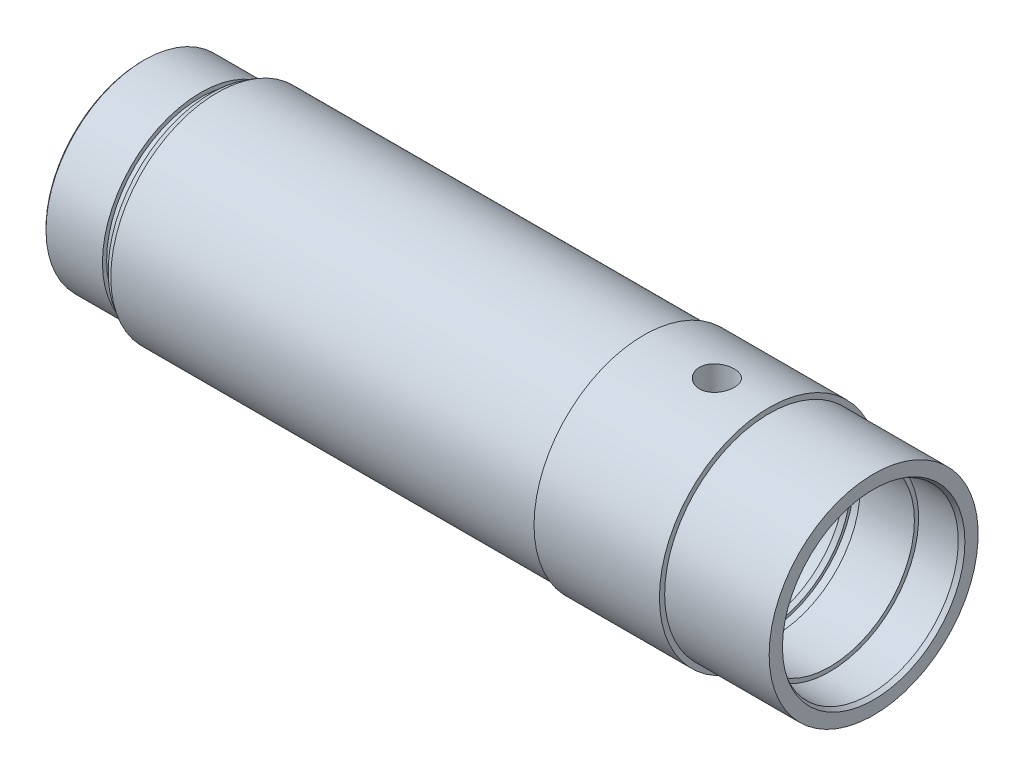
ISO-10303-21;
HEADER;
FILE_DESCRIPTION(('STEP AP214'),'2;1');
FILE_NAME('part.step','',(''),(''),'','','');
FILE_SCHEMA(('AUTOMOTIVE_DESIGN { 1 0 10303 214 1 1 1 1 }'));
ENDSEC;
DATA;
#1=APPLICATION_CONTEXT('core data for automotive mechanical design processes');
#2=APPLICATION_PROTOCOL_DEFINITION('international standard','automotive_design',2000,#1);
#3=PRODUCT_CONTEXT('',#1,'mechanical');
#4=PRODUCT('Part','Part','',(#3));
#5=PRODUCT_RELATED_PRODUCT_CATEGORY('part','',(#4));
#6=PRODUCT_DEFINITION_FORMATION('','',#4);
#7=PRODUCT_DEFINITION_CONTEXT('part definition',#1,'design');
#8=PRODUCT_DEFINITION('design','',#6,#7);
#9=PRODUCT_DEFINITION_SHAPE('','',#8);
#10=(LENGTH_UNIT() NAMED_UNIT(*) SI_UNIT(.MILLI.,.METRE.));
#11=(NAMED_UNIT(*) PLANE_ANGLE_UNIT() SI_UNIT($,.RADIAN.));
#12=(NAMED_UNIT(*) SI_UNIT($,.STERADIAN.) SOLID_ANGLE_UNIT());
#13=UNCERTAINTY_MEASURE_WITH_UNIT(LENGTH_MEASURE(1.E-05),#10,'distance_accuracy_value','');
#14=(GEOMETRIC_REPRESENTATION_CONTEXT(3) GLOBAL_UNCERTAINTY_ASSIGNED_CONTEXT((#13)) GLOBAL_UNIT_ASSIGNED_CONTEXT((#10,
#11,#12)) REPRESENTATION_CONTEXT('',''));
#15=CARTESIAN_POINT('',(0.,0.,0.));
#16=DIRECTION('',(0.,0.,1.));
#17=DIRECTION('',(1.,0.,0.));
#18=AXIS2_PLACEMENT_3D('',#15,#16,#17);
#19=CARTESIAN_POINT('',(0.,0.,0.));
#20=DIRECTION('',(-1.,0.,0.));
#21=DIRECTION('',(0.,0.,1.));
#22=AXIS2_PLACEMENT_3D('',#19,#20,#21);
#23=CYLINDRICAL_SURFACE('',#22,40.);
#24=CARTESIAN_POINT('',(296.,0.,0.));
#25=DIRECTION('',(-1.,0.,0.));
#26=DIRECTION('',(0.,0.,1.));
#27=AXIS2_PLACEMENT_3D('',#24,#25,#26);
#28=CIRCLE('',#27,40.);
#29=CARTESIAN_POINT('',(296.,0.,40.));
#30=VERTEX_POINT('',#29);
#31=EDGE_CURVE('E44',#30,#30,#28,.F.);
#32=ORIENTED_EDGE('',*,*,#31,.T.);
#33=EDGE_LOOP('',(#32));
#34=FACE_BOUND('',#33,.T.);
#35=CARTESIAN_POINT('',(0.,0.,0.));
#36=DIRECTION('',(-1.,0.,0.));
#37=DIRECTION('',(0.,0.,1.));
#38=AXIS2_PLACEMENT_3D('',#35,#36,#37);
#39=CIRCLE('',#38,40.);
#40=CARTESIAN_POINT('',(0.,0.,40.));
#41=VERTEX_POINT('',#40);
#42=EDGE_CURVE('E65',#41,#41,#39,.T.);
#43=ORIENTED_EDGE('',*,*,#42,.T.);
#44=EDGE_LOOP('',(#43));
#45=FACE_BOUND('',#44,.T.);
#46=CARTESIAN_POINT('',(275.,39.1228122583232,-8.33099999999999));
#47=CARTESIAN_POINT('',(275.231316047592,39.1228094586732,-8.33100494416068));
#48=CARTESIAN_POINT('',(275.462571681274,39.1248675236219,-8.32136365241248));
#49=CARTESIAN_POINT('',(275.923477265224,39.1330323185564,-8.28288617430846));
#50=CARTESIAN_POINT('',(276.153126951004,39.1391397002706,-8.25404689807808));
#51=CARTESIAN_POINT('',(276.609202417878,39.1552293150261,-8.17737971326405));
#52=CARTESIAN_POINT('',(276.835626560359,39.1652134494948,-8.12954248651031));
#53=CARTESIAN_POINT('',(277.283621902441,39.1887651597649,-8.01524107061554));
#54=CARTESIAN_POINT('',(277.505191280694,39.2023340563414,-7.94877001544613));
#55=CARTESIAN_POINT('',(277.941530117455,39.2326360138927,-7.79783184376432));
#56=CARTESIAN_POINT('',(278.156308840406,39.2493645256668,-7.71339057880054));
#57=CARTESIAN_POINT('',(278.578014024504,39.2855249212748,-7.52705362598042));
#58=CARTESIAN_POINT('',(278.784937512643,39.3049578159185,-7.42515140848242));
#59=CARTESIAN_POINT('',(279.189368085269,39.3459627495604,-7.20470485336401));
#60=CARTESIAN_POINT('',(279.386879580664,39.3675337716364,-7.08616841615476));
#61=CARTESIAN_POINT('',(279.771380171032,39.4122318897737,-6.83318941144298));
#62=CARTESIAN_POINT('',(279.958364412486,39.4353596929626,-6.69873959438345));
#63=CARTESIAN_POINT('',(280.32298913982,39.4828510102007,-6.41293547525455));
#64=CARTESIAN_POINT('',(280.500465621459,39.5072271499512,-6.26137399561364));
#65=CARTESIAN_POINT('',(280.841989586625,39.5562223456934,-5.94399178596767));
#66=CARTESIAN_POINT('',(281.006042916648,39.5808412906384,-5.77817732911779));
#67=CARTESIAN_POINT('',(281.319778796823,39.6296607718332,-5.43326161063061));
#68=CARTESIAN_POINT('',(281.469454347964,39.6538610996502,-5.25415395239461));
#69=CARTESIAN_POINT('',(281.753263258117,39.7011514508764,-4.88399100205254));
#70=CARTESIAN_POINT('',(281.887402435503,39.7242418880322,-4.69294022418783));
#71=CARTESIAN_POINT('',(282.140507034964,39.7689024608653,-4.29816678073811));
#72=CARTESIAN_POINT('',(282.25930928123,39.7904553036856,-4.09433748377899));
#73=CARTESIAN_POINT('',(282.479248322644,39.8311676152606,-3.67722373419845));
#74=CARTESIAN_POINT('',(282.580391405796,39.8503279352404,-3.46394268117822));
#75=CARTESIAN_POINT('',(282.764300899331,39.8857199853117,-3.02933554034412));
#76=CARTESIAN_POINT('',(282.847065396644,39.9019514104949,-2.80800861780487));
#77=CARTESIAN_POINT('',(282.993549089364,39.9310168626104,-2.35892245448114));
#78=CARTESIAN_POINT('',(283.057268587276,39.9438509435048,-2.13116331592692));
#79=CARTESIAN_POINT('',(283.164376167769,39.965594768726,-1.6741614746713));
#80=CARTESIAN_POINT('',(283.208041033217,39.9745578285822,-1.44498616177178));
#81=CARTESIAN_POINT('',(283.276008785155,39.9885690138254,-0.983664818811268));
#82=CARTESIAN_POINT('',(283.300311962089,39.9936171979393,-0.751518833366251));
#83=CARTESIAN_POINT('',(283.329355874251,39.9996550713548,-0.285974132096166));
#84=CARTESIAN_POINT('',(283.334098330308,40.0006451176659,-0.0525755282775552));
#85=CARTESIAN_POINT('',(283.323986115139,39.9985394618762,0.413777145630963));
#86=CARTESIAN_POINT('',(283.309131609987,39.9954437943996,0.646731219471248));
#87=CARTESIAN_POINT('',(283.260333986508,39.9853348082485,1.10685569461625));
#88=CARTESIAN_POINT('',(283.226692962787,39.9783835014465,1.33405957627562));
#89=CARTESIAN_POINT('',(283.140793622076,39.9607957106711,1.78485480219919));
#90=CARTESIAN_POINT('',(283.088528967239,39.9501579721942,2.00844488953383));
#91=CARTESIAN_POINT('',(282.965800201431,39.9254906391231,2.45033957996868));
#92=CARTESIAN_POINT('',(282.895339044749,39.9114615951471,2.66864503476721));
#93=CARTESIAN_POINT('',(282.736743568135,39.8803911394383,3.09852387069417));
#94=CARTESIAN_POINT('',(282.648608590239,39.8633496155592,3.31009700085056));
#95=CARTESIAN_POINT('',(282.454664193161,39.826590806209,3.72647870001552));
#96=CARTESIAN_POINT('',(282.34874012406,39.806856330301,3.93123233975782));
#97=CARTESIAN_POINT('',(282.120397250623,39.7653353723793,4.33111040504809));
#98=CARTESIAN_POINT('',(281.997978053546,39.7435488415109,4.52623460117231));
#99=CARTESIAN_POINT('',(281.737487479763,39.6985103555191,4.9055855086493));
#100=CARTESIAN_POINT('',(281.599414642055,39.6752582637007,5.0898112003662));
#101=CARTESIAN_POINT('',(281.308560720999,39.6279168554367,5.44614703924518));
#102=CARTESIAN_POINT('',(281.15577943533,39.6038275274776,5.61825701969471));
#103=CARTESIAN_POINT('',(280.83349890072,39.5550035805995,5.95237251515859));
#104=CARTESIAN_POINT('',(280.663738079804,39.5302653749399,6.11412530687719));
#105=CARTESIAN_POINT('',(280.311151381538,39.4812904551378,6.42278201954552));
#106=CARTESIAN_POINT('',(280.128325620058,39.45705373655,6.56968607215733));
#107=CARTESIAN_POINT('',(279.750830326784,39.4097674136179,6.84763563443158));
#108=CARTESIAN_POINT('',(279.55616015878,39.3867178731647,6.97868029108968));
#109=CARTESIAN_POINT('',(279.156311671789,39.3424693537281,7.22396307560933));
#110=CARTESIAN_POINT('',(278.951133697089,39.3212703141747,7.33820175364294));
#111=CARTESIAN_POINT('',(278.531104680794,39.2812846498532,7.54932165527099));
#112=CARTESIAN_POINT('',(278.316229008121,39.2625046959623,7.64615516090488));
#113=CARTESIAN_POINT('',(277.878912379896,39.2279885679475,7.82130963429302));
#114=CARTESIAN_POINT('',(277.656474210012,39.2122512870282,7.89963733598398));
#115=CARTESIAN_POINT('',(277.205538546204,39.1842851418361,8.03720915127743));
#116=CARTESIAN_POINT('',(276.977040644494,39.1720565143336,8.09645197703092));
#117=CARTESIAN_POINT('',(276.515675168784,39.1514828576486,8.1953613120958));
#118=CARTESIAN_POINT('',(276.282807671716,39.1431377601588,8.23502816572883));
#119=CARTESIAN_POINT('',(275.818780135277,39.130704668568,8.29390379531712));
#120=CARTESIAN_POINT('',(275.587668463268,39.1265406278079,8.31347817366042));
#121=CARTESIAN_POINT('',(275.124581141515,39.1223255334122,8.3332916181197));
#122=CARTESIAN_POINT('',(274.892605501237,39.1222744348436,8.33353089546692));
#123=CARTESIAN_POINT('',(274.42949185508,39.1262866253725,8.31467297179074));
#124=CARTESIAN_POINT('',(274.198353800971,39.1303496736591,8.29557690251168));
#125=CARTESIAN_POINT('',(273.738577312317,39.1424681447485,8.23820641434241));
#126=CARTESIAN_POINT('',(273.50993887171,39.1505235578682,8.19993204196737));
#127=CARTESIAN_POINT('',(273.059238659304,39.1702801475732,8.10502755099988));
#128=CARTESIAN_POINT('',(272.837132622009,39.1819412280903,8.04859904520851));
#129=CARTESIAN_POINT('',(272.398430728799,39.2086042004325,7.91769004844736));
#130=CARTESIAN_POINT('',(272.181836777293,39.2236072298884,7.84320340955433));
#131=CARTESIAN_POINT('',(271.755765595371,39.2565203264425,7.67677014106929));
#132=CARTESIAN_POINT('',(271.546286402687,39.2744295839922,7.58482837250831));
#133=CARTESIAN_POINT('',(271.135699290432,39.3126628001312,7.38410313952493));
#134=CARTESIAN_POINT('',(270.934594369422,39.3329876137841,7.27531370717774));
#135=CARTESIAN_POINT('',(270.539419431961,39.3757805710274,7.04005612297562));
#136=CARTESIAN_POINT('',(270.345485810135,39.3982745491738,6.91336354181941));
#137=CARTESIAN_POINT('',(269.968933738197,39.4445325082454,6.64435659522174));
#138=CARTESIAN_POINT('',(269.786315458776,39.4682965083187,6.50204199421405));
#139=CARTESIAN_POINT('',(269.433552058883,39.5164426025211,6.20272040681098));
#140=CARTESIAN_POINT('',(269.263410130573,39.5408248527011,6.04570968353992));
#141=CARTESIAN_POINT('',(268.93682585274,39.5895244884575,5.71812528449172));
#142=CARTESIAN_POINT('',(268.780379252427,39.6138418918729,5.54755584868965));
#143=CARTESIAN_POINT('',(268.479639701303,39.6621624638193,5.19093297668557));
#144=CARTESIAN_POINT('',(268.335597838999,39.6861533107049,5.00466601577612));
#145=CARTESIAN_POINT('',(268.063719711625,39.7327129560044,4.62049273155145));
#146=CARTESIAN_POINT('',(267.935883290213,39.7552817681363,4.42258652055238));
#147=CARTESIAN_POINT('',(267.697341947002,39.7983603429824,4.01649085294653));
#148=CARTESIAN_POINT('',(267.586636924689,39.8188701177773,3.80830145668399));
#149=CARTESIAN_POINT('',(267.383191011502,39.8572481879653,3.38309421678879));
#150=CARTESIAN_POINT('',(267.290449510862,39.8751165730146,3.16607667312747));
#151=CARTESIAN_POINT('',(267.124134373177,39.907606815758,2.72604097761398));
#152=CARTESIAN_POINT('',(267.050451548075,39.9222470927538,2.50306546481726));
#153=CARTESIAN_POINT('',(266.922152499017,39.9479925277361,2.05158303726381));
#154=CARTESIAN_POINT('',(266.867529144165,39.9590990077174,1.82307822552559));
#155=CARTESIAN_POINT('',(266.777751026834,39.977467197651,1.36210360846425));
#156=CARTESIAN_POINT('',(266.742597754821,39.9847286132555,1.12963350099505));
#157=CARTESIAN_POINT('',(266.692058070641,39.9951962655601,0.662464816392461));
#158=CARTESIAN_POINT('',(266.67667137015,39.99840256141,0.427766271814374));
#159=CARTESIAN_POINT('',(266.66589611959,40.000646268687,-0.0376302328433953));
#160=CARTESIAN_POINT('',(266.670132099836,39.9997619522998,-0.26831920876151));
#161=CARTESIAN_POINT('',(266.697717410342,39.9940264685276,-0.728583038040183));
#162=CARTESIAN_POINT('',(266.721073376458,39.989173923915,-0.958157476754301));
#163=CARTESIAN_POINT('',(266.78671240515,39.9756363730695,-1.41441795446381));
#164=CARTESIAN_POINT('',(266.828991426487,39.9669521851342,-1.64110459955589));
#165=CARTESIAN_POINT('',(266.932142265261,39.9459912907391,-2.09004335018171));
#166=CARTESIAN_POINT('',(266.993014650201,39.9337144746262,-2.31229532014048));
#167=CARTESIAN_POINT('',(267.132690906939,39.9059434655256,-2.75021594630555));
#168=CARTESIAN_POINT('',(267.211445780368,39.8904580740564,-2.96590079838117));
#169=CARTESIAN_POINT('',(267.386390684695,39.8566697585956,-3.38985269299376));
#170=CARTESIAN_POINT('',(267.482581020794,39.838366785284,-3.59811960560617));
#171=CARTESIAN_POINT('',(267.691704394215,39.7994356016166,-4.00585508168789));
#172=CARTESIAN_POINT('',(267.804638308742,39.7788072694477,-4.20532318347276));
#173=CARTESIAN_POINT('',(268.046454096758,39.7357784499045,-4.59414599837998));
#174=CARTESIAN_POINT('',(268.175336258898,39.7133779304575,-4.78350052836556));
#175=CARTESIAN_POINT('',(268.450545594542,39.6670024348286,-5.15406575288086));
#176=CARTESIAN_POINT('',(268.597137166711,39.6430068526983,-5.33507755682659));
#177=CARTESIAN_POINT('',(268.904911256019,39.5944625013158,-5.68415337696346));
#178=CARTESIAN_POINT('',(269.066093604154,39.5699137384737,-5.85221754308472));
#179=CARTESIAN_POINT('',(269.402009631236,39.5209352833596,-6.17431982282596));
#180=CARTESIAN_POINT('',(269.576746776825,39.4965056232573,-6.32835432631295));
#181=CARTESIAN_POINT('',(269.938565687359,39.4484525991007,-6.62130093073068));
#182=CARTESIAN_POINT('',(270.125647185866,39.4248292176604,-6.76021335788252));
#183=CARTESIAN_POINT('',(270.513246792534,39.378775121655,-7.0235432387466));
#184=CARTESIAN_POINT('',(270.713900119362,39.3563623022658,-7.14776491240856));
#185=CARTESIAN_POINT('',(271.125119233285,39.3137041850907,-7.37878453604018));
#186=CARTESIAN_POINT('',(271.335681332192,39.2934580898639,-7.48558890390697));
#187=CARTESIAN_POINT('',(271.765201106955,39.2557340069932,-7.68096709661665));
#188=CARTESIAN_POINT('',(271.984153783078,39.2382544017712,-7.76955158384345));
#189=CARTESIAN_POINT('',(272.428929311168,39.2065758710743,-7.92785595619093));
#190=CARTESIAN_POINT('',(272.654750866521,39.1923763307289,-7.99757937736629));
#191=CARTESIAN_POINT('',(273.227886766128,39.1614186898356,-8.14812885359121));
#192=CARTESIAN_POINT('',(273.57865369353,39.1470240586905,-8.21660784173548));
#193=CARTESIAN_POINT('',(274.28632848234,39.1277231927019,-8.30803868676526));
#194=CARTESIAN_POINT('',(274.64323609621,39.1228165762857,-8.3309923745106));
#195=CARTESIAN_POINT('',(275.,39.1228122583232,-8.33099999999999));
#196=B_SPLINE_CURVE_WITH_KNOTS('',3,(#46,#47,#48,#49,#50,#51,#52,#53,#54,#55,#56,#57,#58,#59,
#60,#61,#62,#63,#64,#65,#66,#67,#68,#69,#70,#71,#72,#73,#74,#75,#76,#77,#78,#79,#80,#81,#82,#83,
#84,#85,#86,#87,#88,#89,#90,#91,#92,#93,#94,#95,#96,#97,#98,#99,#100,#101,#102,#103,#104,#105,
#106,#107,#108,#109,#110,#111,#112,#113,#114,#115,#116,#117,#118,#119,#120,#121,#122,#123,#124,
#125,#126,#127,#128,#129,#130,#131,#132,#133,#134,#135,#136,#137,#138,#139,#140,#141,#142,#143,
#144,#145,#146,#147,#148,#149,#150,#151,#152,#153,#154,#155,#156,#157,#158,#159,#160,#161,#162,
#163,#164,#165,#166,#167,#168,#169,#170,#171,#172,#173,#174,#175,#176,#177,#178,#179,#180,#181,
#182,#183,#184,#185,#186,#187,#188,#189,#190,#191,#192,#193,#194,#195),.UNSPECIFIED.,.T.,.F.,(4,
2,2,2,2,2,2,2,2,2,2,2,2,2,2,2,2,2,2,2,2,2,2,2,2,2,2,2,2,2,2,2,2,2,2,2,2,2,2,2,2,2,2,2,2,2,2,2,2,
2,2,2,2,2,2,2,2,2,2,2,2,2,2,2,2,2,2,2,2,2,2,2,2,2,4),(0.,0.693634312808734,1.38738029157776,
2.08146696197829,2.77580972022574,3.46916028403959,4.16277069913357,4.85605279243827,
5.5496519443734,6.25279650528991,6.95563316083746,7.65881023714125,8.36172311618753,
9.07158728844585,9.78119817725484,10.4908828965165,11.200556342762,11.9001169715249,
12.5996671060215,13.2991556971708,13.9986383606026,14.6871841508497,15.375964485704,
16.0646330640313,16.7533272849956,17.446643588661,18.1399764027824,18.8333739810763,
19.5267810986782,20.2333048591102,20.9398223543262,21.646377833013,22.3529101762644,
23.0613509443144,23.7695335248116,24.4777638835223,25.1859817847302,25.8810714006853,
26.5761534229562,27.271194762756,27.966234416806,28.6538072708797,29.3416145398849,
30.0292305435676,30.7170906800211,31.4144986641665,32.111917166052,32.8095134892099,
33.506892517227,34.2160975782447,34.9252957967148,35.6344898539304,36.3436598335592,
37.0486721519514,37.753420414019,38.4582226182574,39.1630145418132,39.8543769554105,
40.5459794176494,41.2374342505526,41.9289101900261,42.6185138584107,43.3081295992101,
43.9977814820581,44.6874458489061,45.3891037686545,46.090753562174,46.7925833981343,
47.4943980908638,48.2047068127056,48.9147532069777,49.624382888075,50.3338794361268,
51.4037301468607,52.4735378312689),.UNSPECIFIED.);
#197=CARTESIAN_POINT('',(275.,39.1228122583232,-8.33099999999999));
#198=VERTEX_POINT('',#197);
#199=EDGE_CURVE('E73',#198,#198,#196,.T.);
#200=ORIENTED_EDGE('',*,*,#199,.F.);
#201=EDGE_LOOP('',(#200));
#202=FACE_BOUND('',#201,.T.);
#203=ADVANCED_FACE('F33',(#34,#45,#202),#23,.F.);
#204=CARTESIAN_POINT('',(0.,0.,0.));
#205=DIRECTION('',(-1.,0.,0.));
#206=DIRECTION('',(0.,0.,1.));
#207=AXIS2_PLACEMENT_3D('',#204,#205,#206);
#208=CYLINDRICAL_SURFACE('',#207,52.5);
#209=CARTESIAN_POINT('',(300.,0.,0.));
#210=DIRECTION('',(-1.,0.,0.));
#211=DIRECTION('',(0.,0.,1.));
#212=AXIS2_PLACEMENT_3D('',#209,#210,#211);
#213=CIRCLE('',#212,52.5);
#214=CARTESIAN_POINT('',(300.,0.,52.5));
#215=VERTEX_POINT('',#214);
#216=EDGE_CURVE('E151',#215,#215,#213,.T.);
#217=ORIENTED_EDGE('',*,*,#216,.T.);
#218=EDGE_LOOP('',(#217));
#219=FACE_BOUND('',#218,.T.);
#220=CARTESIAN_POINT('',(240.,0.,0.));
#221=DIRECTION('',(-1.,0.,0.));
#222=DIRECTION('',(0.,0.,1.));
#223=AXIS2_PLACEMENT_3D('',#220,#221,#222);
#224=CIRCLE('',#223,52.5);
#225=CARTESIAN_POINT('',(240.,0.,52.5));
#226=VERTEX_POINT('',#225);
#227=EDGE_CURVE('E154',#226,#226,#224,.T.);
#228=ORIENTED_EDGE('',*,*,#227,.F.);
#229=EDGE_LOOP('',(#228));
#230=FACE_BOUND('',#229,.T.);
#231=CARTESIAN_POINT('',(275.,51.8347802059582,-8.33099999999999));
#232=CARTESIAN_POINT('',(274.767527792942,51.8347787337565,-8.33100338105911));
#233=CARTESIAN_POINT('',(274.535102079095,51.8363471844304,-8.32126634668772));
#234=CARTESIAN_POINT('',(274.071847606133,51.8425722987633,-8.28239755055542));
#235=CARTESIAN_POINT('',(273.841019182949,51.8472295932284,-8.2532618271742));
#236=CARTESIAN_POINT('',(273.382539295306,51.8595029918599,-8.17578612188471));
#237=CARTESIAN_POINT('',(273.154890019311,51.8671210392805,-8.1274335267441));
#238=CARTESIAN_POINT('',(272.704449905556,51.8850973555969,-8.01187185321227));
#239=CARTESIAN_POINT('',(272.481660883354,51.8954566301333,-7.94465585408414));
#240=CARTESIAN_POINT('',(272.042857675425,51.9186014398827,-7.79196853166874));
#241=CARTESIAN_POINT('',(271.826835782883,51.9313840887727,-7.70651891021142));
#242=CARTESIAN_POINT('',(271.402709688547,51.9590236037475,-7.51790848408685));
#243=CARTESIAN_POINT('',(271.194608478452,51.9738812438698,-7.41474106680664));
#244=CARTESIAN_POINT('',(270.787949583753,52.005237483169,-7.1915202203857));
#245=CARTESIAN_POINT('',(270.589386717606,52.0217351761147,-7.07147610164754));
#246=CARTESIAN_POINT('',(270.20294351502,52.055923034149,-6.81524638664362));
#247=CARTESIAN_POINT('',(270.015068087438,52.073613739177,-6.6790534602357));
#248=CARTESIAN_POINT('',(269.649910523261,52.1098322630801,-6.39036046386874));
#249=CARTESIAN_POINT('',(269.472725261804,52.1283656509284,-6.23773854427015));
#250=CARTESIAN_POINT('',(269.131892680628,52.165605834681,-5.9182275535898));
#251=CARTESIAN_POINT('',(268.968239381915,52.1843125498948,-5.75134485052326));
#252=CARTESIAN_POINT('',(268.655439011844,52.2213917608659,-5.40432220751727));
#253=CARTESIAN_POINT('',(268.506298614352,52.2397640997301,-5.22417623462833));
#254=CARTESIAN_POINT('',(268.223698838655,52.2756449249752,-4.85199746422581));
#255=CARTESIAN_POINT('',(268.090233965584,52.2931537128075,-4.65996886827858));
#256=CARTESIAN_POINT('',(267.839166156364,52.3269186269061,-4.26418177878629));
#257=CARTESIAN_POINT('',(267.721656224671,52.3431671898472,-4.06036362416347));
#258=CARTESIAN_POINT('',(267.504243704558,52.3738409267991,-3.64341538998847));
#259=CARTESIAN_POINT('',(267.404340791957,52.3882661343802,-3.43028548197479));
#260=CARTESIAN_POINT('',(267.222883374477,52.4148826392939,-2.99622268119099));
#261=CARTESIAN_POINT('',(267.141328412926,52.4270739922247,-2.77528998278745));
#262=CARTESIAN_POINT('',(266.99718324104,52.4488744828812,-2.32720268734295));
#263=CARTESIAN_POINT('',(266.934592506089,52.4584836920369,-2.10004826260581));
#264=CARTESIAN_POINT('',(266.829288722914,52.4747775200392,-1.64303802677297));
#265=CARTESIAN_POINT('',(266.786416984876,52.4814854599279,-1.41321960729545));
#266=CARTESIAN_POINT('',(266.72014160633,52.4918986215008,-0.950809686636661));
#267=CARTESIAN_POINT('',(266.696730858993,52.4956049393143,-0.718219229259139));
#268=CARTESIAN_POINT('',(266.669531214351,52.4999139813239,-0.251835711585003));
#269=CARTESIAN_POINT('',(266.665744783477,52.500516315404,-0.018042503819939));
#270=CARTESIAN_POINT('',(266.677830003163,52.4985991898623,0.449021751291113));
#271=CARTESIAN_POINT('',(266.693701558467,52.4960797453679,0.682292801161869));
#272=CARTESIAN_POINT('',(266.744743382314,52.4880279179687,1.14449196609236));
#273=CARTESIAN_POINT('',(266.779735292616,52.4825233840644,1.37344029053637));
#274=CARTESIAN_POINT('',(266.868646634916,52.4686708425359,1.82762678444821));
#275=CARTESIAN_POINT('',(266.922572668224,52.4603218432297,2.05286363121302));
#276=CARTESIAN_POINT('',(267.04893517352,52.4410142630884,2.49792565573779));
#277=CARTESIAN_POINT('',(267.12136847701,52.4300561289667,2.71775175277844));
#278=CARTESIAN_POINT('',(267.284218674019,52.4058321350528,3.1505130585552));
#279=CARTESIAN_POINT('',(267.374636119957,52.3925662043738,3.36344805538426));
#280=CARTESIAN_POINT('',(267.573212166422,52.3640327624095,3.7818282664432));
#281=CARTESIAN_POINT('',(267.681442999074,52.3487571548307,3.98723864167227));
#282=CARTESIAN_POINT('',(267.914606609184,52.3166695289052,4.38822893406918));
#283=CARTESIAN_POINT('',(268.03953977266,52.2998574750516,4.58380862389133));
#284=CARTESIAN_POINT('',(268.3052367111,52.2651600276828,4.96381488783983));
#285=CARTESIAN_POINT('',(268.446001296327,52.2472745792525,5.14824089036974));
#286=CARTESIAN_POINT('',(268.742384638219,52.2109238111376,5.50468307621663));
#287=CARTESIAN_POINT('',(268.898003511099,52.192458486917,5.67669916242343));
#288=CARTESIAN_POINT('',(269.224827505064,52.1552530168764,6.00898042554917));
#289=CARTESIAN_POINT('',(269.396185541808,52.136512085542,6.16909514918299));
#290=CARTESIAN_POINT('',(269.751811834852,52.0994880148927,6.47433330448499));
#291=CARTESIAN_POINT('',(269.936079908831,52.0812048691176,6.61945694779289));
#292=CARTESIAN_POINT('',(270.316263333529,52.0456147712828,6.89370077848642));
#293=CARTESIAN_POINT('',(270.51217909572,52.028307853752,7.0228204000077));
#294=CARTESIAN_POINT('',(270.914288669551,51.9951664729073,7.26412430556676));
#295=CARTESIAN_POINT('',(271.120482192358,51.9793319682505,7.37630906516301));
#296=CARTESIAN_POINT('',(271.541956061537,51.9495743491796,7.58305026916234));
#297=CARTESIAN_POINT('',(271.757246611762,51.9356534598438,7.67758623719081));
#298=CARTESIAN_POINT('',(272.195089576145,51.9101552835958,7.84813456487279));
#299=CARTESIAN_POINT('',(272.417639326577,51.8985771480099,7.92415363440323));
#300=CARTESIAN_POINT('',(272.868509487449,51.878097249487,8.05714327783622));
#301=CARTESIAN_POINT('',(273.096830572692,51.8691958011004,8.11411161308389));
#302=CARTESIAN_POINT('',(273.557564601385,51.8543349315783,8.20854663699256));
#303=CARTESIAN_POINT('',(273.789977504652,51.8483754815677,8.24601351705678));
#304=CARTESIAN_POINT('',(274.25462187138,51.8396245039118,8.30084899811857));
#305=CARTESIAN_POINT('',(274.48682711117,51.8367987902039,8.31843452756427));
#306=CARTESIAN_POINT('',(274.951994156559,51.8342804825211,8.33411249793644));
#307=CARTESIAN_POINT('',(275.184956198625,51.8345889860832,8.33219811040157));
#308=CARTESIAN_POINT('',(275.649824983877,51.8383323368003,8.30887710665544));
#309=CARTESIAN_POINT('',(275.881731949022,51.8417664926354,8.28747480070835));
#310=CARTESIAN_POINT('',(276.342881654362,51.851659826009,8.22534865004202));
#311=CARTESIAN_POINT('',(276.572124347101,51.8581190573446,8.18462446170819));
#312=CARTESIAN_POINT('',(277.025008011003,51.8738293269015,8.08445309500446));
#313=CARTESIAN_POINT('',(277.2486734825,51.8830642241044,8.02511408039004));
#314=CARTESIAN_POINT('',(277.690190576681,51.9040743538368,7.88808376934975));
#315=CARTESIAN_POINT('',(277.908042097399,51.9158496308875,7.81039215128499));
#316=CARTESIAN_POINT('',(278.336394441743,51.9416043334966,7.63723732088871));
#317=CARTESIAN_POINT('',(278.546896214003,51.9555834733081,7.54177641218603));
#318=CARTESIAN_POINT('',(278.959209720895,51.9853583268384,7.33372753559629));
#319=CARTESIAN_POINT('',(279.161018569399,52.0011546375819,7.22113393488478));
#320=CARTESIAN_POINT('',(279.556129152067,52.0342548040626,6.97864011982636));
#321=CARTESIAN_POINT('',(279.749347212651,52.0515699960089,6.84860511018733));
#322=CARTESIAN_POINT('',(280.124170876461,52.087107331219,6.57286591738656));
#323=CARTESIAN_POINT('',(280.305776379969,52.1053294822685,6.42716159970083));
#324=CARTESIAN_POINT('',(280.656176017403,52.1421748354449,6.12105913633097));
#325=CARTESIAN_POINT('',(280.824967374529,52.1607981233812,5.96065782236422));
#326=CARTESIAN_POINT('',(281.148491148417,52.1979172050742,5.62634071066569));
#327=CARTESIAN_POINT('',(281.303228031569,52.2164130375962,5.45242923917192));
#328=CARTESIAN_POINT('',(281.599049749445,52.2529438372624,5.09050569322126));
#329=CARTESIAN_POINT('',(281.739989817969,52.2709727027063,4.90237463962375));
#330=CARTESIAN_POINT('',(282.005515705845,52.3058731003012,4.51480762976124));
#331=CARTESIAN_POINT('',(282.130101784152,52.3227446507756,4.31537185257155));
#332=CARTESIAN_POINT('',(282.362023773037,52.3548530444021,3.90658295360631));
#333=CARTESIAN_POINT('',(282.469359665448,52.3700898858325,3.69722982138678));
#334=CARTESIAN_POINT('',(282.665988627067,52.3984956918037,3.27008501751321));
#335=CARTESIAN_POINT('',(282.755282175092,52.4116647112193,3.05229356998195));
#336=CARTESIAN_POINT('',(282.914850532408,52.4355136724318,2.6106725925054));
#337=CARTESIAN_POINT('',(282.985197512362,52.4462030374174,2.38686965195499));
#338=CARTESIAN_POINT('',(283.106770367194,52.4648506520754,1.9341040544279));
#339=CARTESIAN_POINT('',(283.158003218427,52.472809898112,1.70514331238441));
#340=CARTESIAN_POINT('',(283.240994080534,52.4857765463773,1.24360754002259));
#341=CARTESIAN_POINT('',(283.272749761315,52.4907835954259,1.01103208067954));
#342=CARTESIAN_POINT('',(283.316528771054,52.4977010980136,0.543986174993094));
#343=CARTESIAN_POINT('',(283.328552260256,52.4996115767,0.309515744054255));
#344=CARTESIAN_POINT('',(283.332749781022,52.5002776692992,-0.156986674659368));
#345=CARTESIAN_POINT('',(283.325143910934,52.4990682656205,-0.389016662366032));
#346=CARTESIAN_POINT('',(283.290599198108,52.4936013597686,-0.851678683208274));
#347=CARTESIAN_POINT('',(283.263653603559,52.4893427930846,-1.08231019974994));
#348=CARTESIAN_POINT('',(283.190635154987,52.4778967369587,-1.54040317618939));
#349=CARTESIAN_POINT('',(283.144566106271,52.4707098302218,-1.76786525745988));
#350=CARTESIAN_POINT('',(283.033648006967,52.4536075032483,-2.21806400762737));
#351=CARTESIAN_POINT('',(282.968798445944,52.4436920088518,-2.44080054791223));
#352=CARTESIAN_POINT('',(282.820873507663,52.4214189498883,-2.87977307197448));
#353=CARTESIAN_POINT('',(282.737815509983,52.4090637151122,-3.09601503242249));
#354=CARTESIAN_POINT('',(282.554043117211,52.3822464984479,-3.52072916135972));
#355=CARTESIAN_POINT('',(282.453328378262,52.367784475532,-3.72920117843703));
#356=CARTESIAN_POINT('',(282.234963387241,52.3371517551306,-4.13694965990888));
#357=CARTESIAN_POINT('',(282.117312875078,52.3209810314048,-4.33622598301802));
#358=CARTESIAN_POINT('',(281.865903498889,52.2873747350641,-4.72423227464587));
#359=CARTESIAN_POINT('',(281.732144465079,52.2699391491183,-4.91296213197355));
#360=CARTESIAN_POINT('',(281.44796418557,52.234094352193,-5.28051547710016));
#361=CARTESIAN_POINT('',(281.297383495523,52.2156768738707,-5.45921490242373));
#362=CARTESIAN_POINT('',(280.981768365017,52.1785534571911,-5.80331916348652));
#363=CARTESIAN_POINT('',(280.816734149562,52.1598475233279,-5.9687242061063));
#364=CARTESIAN_POINT('',(280.473301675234,52.1226661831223,-6.28514600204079));
#365=CARTESIAN_POINT('',(280.294900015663,52.1041908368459,-6.43615907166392));
#366=CARTESIAN_POINT('',(279.925998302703,52.0679960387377,-6.72269656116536));
#367=CARTESIAN_POINT('',(279.735498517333,52.050276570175,-6.85822132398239));
#368=CARTESIAN_POINT('',(279.342417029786,52.0159826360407,-7.11366815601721));
#369=CARTESIAN_POINT('',(279.13976423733,51.9994164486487,-7.23348198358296));
#370=CARTESIAN_POINT('',(278.725019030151,51.9680427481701,-7.45554208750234));
#371=CARTESIAN_POINT('',(278.512930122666,51.9532345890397,-7.55779482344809));
#372=CARTESIAN_POINT('',(278.080887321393,51.9258113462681,-7.74396375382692));
#373=CARTESIAN_POINT('',(277.860939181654,51.9131946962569,-7.82789305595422));
#374=CARTESIAN_POINT('',(277.414683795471,51.8905140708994,-7.97685452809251));
#375=CARTESIAN_POINT('',(277.188377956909,51.8804495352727,-8.04189084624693));
#376=CARTESIAN_POINT('',(276.639381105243,51.8597126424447,-8.17474637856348));
#377=CARTESIAN_POINT('',(276.314343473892,51.8504073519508,-8.23327380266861));
#378=CARTESIAN_POINT('',(275.659506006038,51.8379422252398,-8.31139791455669));
#379=CARTESIAN_POINT('',(275.329706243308,51.8347822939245,-8.33099520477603));
#380=CARTESIAN_POINT('',(275.,51.8347802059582,-8.33099999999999));
#381=B_SPLINE_CURVE_WITH_KNOTS('',3,(#231,#232,#233,#234,#235,#236,#237,#238,#239,#240,#241,
#242,#243,#244,#245,#246,#247,#248,#249,#250,#251,#252,#253,#254,#255,#256,#257,#258,#259,#260,
#261,#262,#263,#264,#265,#266,#267,#268,#269,#270,#271,#272,#273,#274,#275,#276,#277,#278,#279,
#280,#281,#282,#283,#284,#285,#286,#287,#288,#289,#290,#291,#292,#293,#294,#295,#296,#297,#298,
#299,#300,#301,#302,#303,#304,#305,#306,#307,#308,#309,#310,#311,#312,#313,#314,#315,#316,#317,
#318,#319,#320,#321,#322,#323,#324,#325,#326,#327,#328,#329,#330,#331,#332,#333,#334,#335,#336,
#337,#338,#339,#340,#341,#342,#343,#344,#345,#346,#347,#348,#349,#350,#351,#352,#353,#354,#355,
#356,#357,#358,#359,#360,#361,#362,#363,#364,#365,#366,#367,#368,#369,#370,#371,#372,#373,#374,
#375,#376,#377,#378,#379,#380),.UNSPECIFIED.,.T.,.F.,(4,2,2,2,2,2,2,2,2,2,2,2,2,2,2,2,2,2,2,2,2,
2,2,2,2,2,2,2,2,2,2,2,2,2,2,2,2,2,2,2,2,2,2,2,2,2,2,2,2,2,2,2,2,2,2,2,2,2,2,2,2,2,2,2,2,2,2,2,2,
2,2,2,2,2,4),(0.,0.697127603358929,1.39439761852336,2.09212605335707,2.79011081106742,
3.48726940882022,4.18468876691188,4.88172487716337,5.57907860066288,6.28201652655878,
6.98464218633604,7.68758944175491,8.39028954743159,9.09692445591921,9.80354635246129,
10.5101506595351,11.2167354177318,11.9175298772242,12.6180683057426,13.318694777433,
14.0193178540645,14.7135142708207,15.4079529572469,16.1022728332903,16.7966140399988,
17.4938434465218,18.1910889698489,18.8883701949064,19.5856568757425,20.2906307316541,
20.9955946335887,21.7005834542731,22.4055524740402,23.1113343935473,23.8168601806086,
24.5224688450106,25.2280705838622,25.9258967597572,26.6239673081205,27.3218834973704,
28.0198120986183,28.7137581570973,29.4077163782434,30.1015846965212,30.7956816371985,
31.495490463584,32.1953052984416,32.8952713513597,33.5950141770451,34.3014512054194,
35.0078770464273,35.7143036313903,36.4207114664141,37.1243891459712,37.8278097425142,
38.5313144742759,39.2348134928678,39.9304587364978,40.6263469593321,41.3220967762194,
42.0178655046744,42.7129730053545,43.4080940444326,44.1032257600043,44.7983648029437,
45.5007645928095,46.2031534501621,46.9057216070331,47.6082742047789,48.3154378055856,
49.0223407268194,49.7287362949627,50.4349766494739,51.4237007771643,52.4124096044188),.UNSPECIFIED.);
#382=CARTESIAN_POINT('',(275.,51.8347802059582,-8.33099999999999));
#383=VERTEX_POINT('',#382);
#384=EDGE_CURVE('E66',#383,#383,#381,.T.);
#385=ORIENTED_EDGE('',*,*,#384,.F.);
#386=EDGE_LOOP('',(#385));
#387=FACE_BOUND('',#386,.T.);
#388=ADVANCED_FACE('F75',(#219,#230,#387),#208,.T.);
#389=CARTESIAN_POINT('',(0.,47.,0.));
#390=DIRECTION('',(1.,0.,0.));
#391=DIRECTION('',(0.,0.,-1.));
#392=AXIS2_PLACEMENT_3D('',#389,#390,#391);
#393=PLANE('',#392);
#394=CARTESIAN_POINT('',(0.,0.,0.));
#395=DIRECTION('',(1.,0.,0.));
#396=DIRECTION('',(0.,0.,-1.));
#397=AXIS2_PLACEMENT_3D('',#394,#395,#396);
#398=CIRCLE('',#397,46.);
#399=CARTESIAN_POINT('',(0.,0.,-46.));
#400=VERTEX_POINT('',#399);
#401=EDGE_CURVE('E62',#400,#400,#398,.F.);
#402=ORIENTED_EDGE('',*,*,#401,.T.);
#403=EDGE_LOOP('',(#402));
#404=FACE_BOUND('',#403,.T.);
#405=ORIENTED_EDGE('',*,*,#42,.F.);
#406=EDGE_LOOP('',(#405));
#407=FACE_BOUND('',#406,.T.);
#408=ADVANCED_FACE('F103',(#404,#407),#393,.F.);
#409=CARTESIAN_POINT('',(298.,40.,0.));
#410=DIRECTION('',(-1.,0.,0.));
#411=DIRECTION('',(0.,0.,1.));
#412=AXIS2_PLACEMENT_3D('',#409,#410,#411);
#413=PLANE('',#412);
#414=CARTESIAN_POINT('',(298.,0.,0.));
#415=DIRECTION('',(-1.,0.,0.));
#416=DIRECTION('',(0.,0.,1.));
#417=AXIS2_PLACEMENT_3D('',#414,#415,#416);
#418=CIRCLE('',#417,41.1547005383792);
#419=CARTESIAN_POINT('',(298.,0.,41.1547005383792));
#420=VERTEX_POINT('',#419);
#421=EDGE_CURVE('E48',#420,#420,#418,.T.);
#422=ORIENTED_EDGE('',*,*,#421,.T.);
#423=EDGE_LOOP('',(#422));
#424=FACE_BOUND('',#423,.T.);
#425=CARTESIAN_POINT('',(298.,0.,0.));
#426=DIRECTION('',(-1.,0.,0.));
#427=DIRECTION('',(0.,0.,1.));
#428=AXIS2_PLACEMENT_3D('',#425,#426,#427);
#429=CIRCLE('',#428,42.5);
#430=CARTESIAN_POINT('',(298.,0.,42.5));
#431=VERTEX_POINT('',#430);
#432=EDGE_CURVE('E129',#431,#431,#429,.T.);
#433=ORIENTED_EDGE('',*,*,#432,.F.);
#434=EDGE_LOOP('',(#433));
#435=FACE_BOUND('',#434,.T.);
#436=ADVANCED_FACE('F101',(#424,#435),#413,.F.);
#437=CARTESIAN_POINT('',(0.,0.,0.));
#438=DIRECTION('',(-1.,0.,0.));
#439=DIRECTION('',(0.,0.,1.));
#440=AXIS2_PLACEMENT_3D('',#437,#438,#439);
#441=CYLINDRICAL_SURFACE('',#440,42.5);
#442=CARTESIAN_POINT('',(303.,0.,0.));
#443=DIRECTION('',(-1.,0.,0.));
#444=DIRECTION('',(0.,0.,1.));
#445=AXIS2_PLACEMENT_3D('',#442,#443,#444);
#446=CIRCLE('',#445,42.5);
#447=CARTESIAN_POINT('',(303.,0.,42.5));
#448=VERTEX_POINT('',#447);
#449=EDGE_CURVE('E131',#448,#448,#446,.T.);
#450=ORIENTED_EDGE('',*,*,#449,.F.);
#451=EDGE_LOOP('',(#450));
#452=FACE_BOUND('',#451,.T.);
#453=ORIENTED_EDGE('',*,*,#432,.T.);
#454=EDGE_LOOP('',(#453));
#455=FACE_BOUND('',#454,.T.);
#456=ADVANCED_FACE('F126',(#452,#455),#441,.F.);
#457=CARTESIAN_POINT('',(303.,42.5,0.));
#458=DIRECTION('',(1.,0.,0.));
#459=DIRECTION('',(0.,0.,-1.));
#460=AXIS2_PLACEMENT_3D('',#457,#458,#459);
#461=PLANE('',#460);
#462=CARTESIAN_POINT('',(303.,0.,0.));
#463=DIRECTION('',(-1.,0.,0.));
#464=DIRECTION('',(0.,0.,1.));
#465=AXIS2_PLACEMENT_3D('',#462,#463,#464);
#466=CIRCLE('',#465,40.5);
#467=CARTESIAN_POINT('',(303.,0.,40.5));
#468=VERTEX_POINT('',#467);
#469=EDGE_CURVE('E134',#468,#468,#466,.T.);
#470=ORIENTED_EDGE('',*,*,#469,.F.);
#471=EDGE_LOOP('',(#470));
#472=FACE_BOUND('',#471,.T.);
#473=ORIENTED_EDGE('',*,*,#449,.T.);
#474=EDGE_LOOP('',(#473));
#475=FACE_BOUND('',#474,.T.);
#476=ADVANCED_FACE('F235',(#472,#475),#461,.F.);
#477=CARTESIAN_POINT('',(0.,0.,0.));
#478=DIRECTION('',(-1.,0.,0.));
#479=DIRECTION('',(0.,0.,1.));
#480=AXIS2_PLACEMENT_3D('',#477,#478,#479);
#481=CYLINDRICAL_SURFACE('',#480,40.5);
#482=CARTESIAN_POINT('',(329.,0.,0.));
#483=DIRECTION('',(-1.,0.,0.));
#484=DIRECTION('',(0.,0.,1.));
#485=AXIS2_PLACEMENT_3D('',#482,#483,#484);
#486=CIRCLE('',#485,40.5);
#487=CARTESIAN_POINT('',(329.,0.,40.5));
#488=VERTEX_POINT('',#487);
#489=EDGE_CURVE('E139',#488,#488,#486,.T.);
#490=ORIENTED_EDGE('',*,*,#489,.F.);
#491=EDGE_LOOP('',(#490));
#492=FACE_BOUND('',#491,.T.);
#493=ORIENTED_EDGE('',*,*,#469,.T.);
#494=EDGE_LOOP('',(#493));
#495=FACE_BOUND('',#494,.T.);
#496=ADVANCED_FACE('F231',(#492,#495),#481,.F.);
#497=CARTESIAN_POINT('',(329.,40.5,0.));
#498=DIRECTION('',(-1.,0.,0.));
#499=DIRECTION('',(0.,0.,1.));
#500=AXIS2_PLACEMENT_3D('',#497,#498,#499);
#501=PLANE('',#500);
#502=CARTESIAN_POINT('',(329.,0.,0.));
#503=DIRECTION('',(-1.,0.,0.));
#504=DIRECTION('',(0.,0.,1.));
#505=AXIS2_PLACEMENT_3D('',#502,#503,#504);
#506=CIRCLE('',#505,42.5);
#507=CARTESIAN_POINT('',(329.,0.,42.5));
#508=VERTEX_POINT('',#507);
#509=EDGE_CURVE('E142',#508,#508,#506,.T.);
#510=ORIENTED_EDGE('',*,*,#509,.F.);
#511=EDGE_LOOP('',(#510));
#512=FACE_BOUND('',#511,.T.);
#513=ORIENTED_EDGE('',*,*,#489,.T.);
#514=EDGE_LOOP('',(#513));
#515=FACE_BOUND('',#514,.T.);
#516=ADVANCED_FACE('F226',(#512,#515),#501,.F.);
#517=CARTESIAN_POINT('',(0.,0.,0.));
#518=DIRECTION('',(-1.,0.,0.));
#519=DIRECTION('',(0.,0.,1.));
#520=AXIS2_PLACEMENT_3D('',#517,#518,#519);
#521=CYLINDRICAL_SURFACE('',#520,42.5);
#522=CARTESIAN_POINT('',(348.,0.,0.));
#523=DIRECTION('',(-1.,0.,0.));
#524=DIRECTION('',(0.,0.,1.));
#525=AXIS2_PLACEMENT_3D('',#522,#523,#524);
#526=CIRCLE('',#525,42.5);
#527=CARTESIAN_POINT('',(348.,0.,42.5));
#528=VERTEX_POINT('',#527);
#529=EDGE_CURVE('E10',#528,#528,#526,.F.);
#530=ORIENTED_EDGE('',*,*,#529,.T.);
#531=EDGE_LOOP('',(#530));
#532=FACE_BOUND('',#531,.T.);
#533=ORIENTED_EDGE('',*,*,#509,.T.);
#534=EDGE_LOOP('',(#533));
#535=FACE_BOUND('',#534,.T.);
#536=ADVANCED_FACE('F221',(#532,#535),#521,.F.);
#537=CARTESIAN_POINT('',(350.,42.5,0.));
#538=DIRECTION('',(-1.,0.,0.));
#539=DIRECTION('',(0.,0.,1.));
#540=AXIS2_PLACEMENT_3D('',#537,#538,#539);
#541=PLANE('',#540);
#542=CARTESIAN_POINT('',(350.,0.,0.));
#543=DIRECTION('',(-1.,0.,0.));
#544=DIRECTION('',(0.,0.,1.));
#545=AXIS2_PLACEMENT_3D('',#542,#543,#544);
#546=CIRCLE('',#545,43.6547005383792);
#547=CARTESIAN_POINT('',(350.,0.,43.6547005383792));
#548=VERTEX_POINT('',#547);
#549=EDGE_CURVE('E40',#548,#548,#546,.T.);
#550=ORIENTED_EDGE('',*,*,#549,.T.);
#551=EDGE_LOOP('',(#550));
#552=FACE_BOUND('',#551,.T.);
#553=CARTESIAN_POINT('',(350.,0.,0.));
#554=DIRECTION('',(-1.,0.,0.));
#555=DIRECTION('',(0.,0.,1.));
#556=AXIS2_PLACEMENT_3D('',#553,#554,#555);
#557=CIRCLE('',#556,50.);
#558=CARTESIAN_POINT('',(350.,0.,50.));
#559=VERTEX_POINT('',#558);
#560=EDGE_CURVE('E145',#559,#559,#557,.T.);
#561=ORIENTED_EDGE('',*,*,#560,.F.);
#562=EDGE_LOOP('',(#561));
#563=FACE_BOUND('',#562,.T.);
#564=ADVANCED_FACE('F216',(#552,#563),#541,.F.);
#565=CARTESIAN_POINT('',(0.,0.,0.));
#566=DIRECTION('',(-1.,0.,0.));
#567=DIRECTION('',(0.,0.,1.));
#568=AXIS2_PLACEMENT_3D('',#565,#566,#567);
#569=CYLINDRICAL_SURFACE('',#568,50.);
#570=CARTESIAN_POINT('',(300.,0.,0.));
#571=DIRECTION('',(-1.,0.,0.));
#572=DIRECTION('',(0.,0.,1.));
#573=AXIS2_PLACEMENT_3D('',#570,#571,#572);
#574=CIRCLE('',#573,50.);
#575=CARTESIAN_POINT('',(300.,0.,50.));
#576=VERTEX_POINT('',#575);
#577=EDGE_CURVE('E148',#576,#576,#574,.T.);
#578=ORIENTED_EDGE('',*,*,#577,.F.);
#579=EDGE_LOOP('',(#578));
#580=FACE_BOUND('',#579,.T.);
#581=ORIENTED_EDGE('',*,*,#560,.T.);
#582=EDGE_LOOP('',(#581));
#583=FACE_BOUND('',#582,.T.);
#584=ADVANCED_FACE('F195',(#580,#583),#569,.T.);
#585=CARTESIAN_POINT('',(300.,50.,0.));
#586=DIRECTION('',(-1.,0.,0.));
#587=DIRECTION('',(0.,0.,1.));
#588=AXIS2_PLACEMENT_3D('',#585,#586,#587);
#589=PLANE('',#588);
#590=ORIENTED_EDGE('',*,*,#216,.F.);
#591=EDGE_LOOP('',(#590));
#592=FACE_BOUND('',#591,.T.);
#593=ORIENTED_EDGE('',*,*,#577,.T.);
#594=EDGE_LOOP('',(#593));
#595=FACE_BOUND('',#594,.T.);
#596=ADVANCED_FACE('F190',(#592,#595),#589,.F.);
#597=CARTESIAN_POINT('',(240.,52.5,0.));
#598=DIRECTION('',(1.,0.,0.));
#599=DIRECTION('',(0.,0.,-1.));
#600=AXIS2_PLACEMENT_3D('',#597,#598,#599);
#601=PLANE('',#600);
#602=CARTESIAN_POINT('',(240.,0.,0.));
#603=DIRECTION('',(-1.,0.,0.));
#604=DIRECTION('',(0.,0.,1.));
#605=AXIS2_PLACEMENT_3D('',#602,#603,#604);
#606=CIRCLE('',#605,51.);
#607=CARTESIAN_POINT('',(240.,0.,51.));
#608=VERTEX_POINT('',#607);
#609=EDGE_CURVE('E157',#608,#608,#606,.T.);
#610=ORIENTED_EDGE('',*,*,#609,.F.);
#611=EDGE_LOOP('',(#610));
#612=FACE_BOUND('',#611,.T.);
#613=ORIENTED_EDGE('',*,*,#227,.T.);
#614=EDGE_LOOP('',(#613));
#615=FACE_BOUND('',#614,.T.);
#616=ADVANCED_FACE('F187',(#612,#615),#601,.F.);
#617=CARTESIAN_POINT('',(0.,0.,0.));
#618=DIRECTION('',(-1.,0.,0.));
#619=DIRECTION('',(0.,0.,1.));
#620=AXIS2_PLACEMENT_3D('',#617,#618,#619);
#621=CYLINDRICAL_SURFACE('',#620,51.);
#622=CARTESIAN_POINT('',(35.9999999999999,0.,0.));
#623=DIRECTION('',(1.,0.,0.));
#624=DIRECTION('',(0.,0.,-1.));
#625=AXIS2_PLACEMENT_3D('',#622,#623,#624);
#626=CIRCLE('',#625,51.);
#627=CARTESIAN_POINT('',(35.9999999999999,0.,-51.));
#628=VERTEX_POINT('',#627);
#629=EDGE_CURVE('E53',#628,#628,#626,.T.);
#630=ORIENTED_EDGE('',*,*,#629,.T.);
#631=EDGE_LOOP('',(#630));
#632=FACE_BOUND('',#631,.T.);
#633=ORIENTED_EDGE('',*,*,#609,.T.);
#634=EDGE_LOOP('',(#633));
#635=FACE_BOUND('',#634,.T.);
#636=ADVANCED_FACE('F184',(#632,#635),#621,.T.);
#637=CARTESIAN_POINT('',(33.,51.,0.));
#638=DIRECTION('',(1.,0.,0.));
#639=DIRECTION('',(0.,0.,-1.));
#640=AXIS2_PLACEMENT_3D('',#637,#638,#639);
#641=PLANE('',#640);
#642=CARTESIAN_POINT('',(33.,0.,0.));
#643=DIRECTION('',(1.,0.,0.));
#644=DIRECTION('',(0.,0.,-1.));
#645=AXIS2_PLACEMENT_3D('',#642,#643,#644);
#646=CIRCLE('',#645,49.2679491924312);
#647=CARTESIAN_POINT('',(33.,0.,-49.2679491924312));
#648=VERTEX_POINT('',#647);
#649=EDGE_CURVE('E56',#648,#648,#646,.F.);
#650=ORIENTED_EDGE('',*,*,#649,.T.);
#651=EDGE_LOOP('',(#650));
#652=FACE_BOUND('',#651,.T.);
#653=CARTESIAN_POINT('',(33.,0.,0.));
#654=DIRECTION('',(-1.,0.,0.));
#655=DIRECTION('',(0.,0.,1.));
#656=AXIS2_PLACEMENT_3D('',#653,#654,#655);
#657=CIRCLE('',#656,45.);
#658=CARTESIAN_POINT('',(33.,0.,45.));
#659=VERTEX_POINT('',#658);
#660=EDGE_CURVE('E160',#659,#659,#657,.T.);
#661=ORIENTED_EDGE('',*,*,#660,.F.);
#662=EDGE_LOOP('',(#661));
#663=FACE_BOUND('',#662,.T.);
#664=ADVANCED_FACE('F178',(#652,#663),#641,.F.);
#665=CARTESIAN_POINT('',(0.,0.,0.));
#666=DIRECTION('',(-1.,0.,0.));
#667=DIRECTION('',(0.,0.,1.));
#668=AXIS2_PLACEMENT_3D('',#665,#666,#667);
#669=CYLINDRICAL_SURFACE('',#668,45.);
#670=CARTESIAN_POINT('',(28.,0.,0.));
#671=DIRECTION('',(-1.,0.,0.));
#672=DIRECTION('',(0.,0.,1.));
#673=AXIS2_PLACEMENT_3D('',#670,#671,#672);
#674=CIRCLE('',#673,45.);
#675=CARTESIAN_POINT('',(28.,0.,45.));
#676=VERTEX_POINT('',#675);
#677=EDGE_CURVE('E162',#676,#676,#674,.T.);
#678=ORIENTED_EDGE('',*,*,#677,.F.);
#679=EDGE_LOOP('',(#678));
#680=FACE_BOUND('',#679,.T.);
#681=ORIENTED_EDGE('',*,*,#660,.T.);
#682=EDGE_LOOP('',(#681));
#683=FACE_BOUND('',#682,.T.);
#684=ADVANCED_FACE('F172',(#680,#683),#669,.T.);
#685=CARTESIAN_POINT('',(28.,45.,0.));
#686=DIRECTION('',(-1.,0.,0.));
#687=DIRECTION('',(0.,0.,1.));
#688=AXIS2_PLACEMENT_3D('',#685,#686,#687);
#689=PLANE('',#688);
#690=CARTESIAN_POINT('',(28.,0.,0.));
#691=DIRECTION('',(-1.,0.,0.));
#692=DIRECTION('',(0.,0.,1.));
#693=AXIS2_PLACEMENT_3D('',#690,#691,#692);
#694=CIRCLE('',#693,47.);
#695=CARTESIAN_POINT('',(28.,0.,47.));
#696=VERTEX_POINT('',#695);
#697=EDGE_CURVE('E94',#696,#696,#694,.T.);
#698=ORIENTED_EDGE('',*,*,#697,.F.);
#699=EDGE_LOOP('',(#698));
#700=FACE_BOUND('',#699,.T.);
#701=ORIENTED_EDGE('',*,*,#677,.T.);
#702=EDGE_LOOP('',(#701));
#703=FACE_BOUND('',#702,.T.);
#704=ADVANCED_FACE('F170',(#700,#703),#689,.F.);
#705=CARTESIAN_POINT('',(0.,0.,0.));
#706=DIRECTION('',(-1.,0.,0.));
#707=DIRECTION('',(0.,0.,1.));
#708=AXIS2_PLACEMENT_3D('',#705,#706,#707);
#709=CYLINDRICAL_SURFACE('',#708,47.);
#710=CARTESIAN_POINT('',(1.00000000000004,0.,0.));
#711=DIRECTION('',(1.,0.,0.));
#712=DIRECTION('',(0.,0.,-1.));
#713=AXIS2_PLACEMENT_3D('',#710,#711,#712);
#714=CIRCLE('',#713,47.);
#715=CARTESIAN_POINT('',(1.00000000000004,0.,-47.));
#716=VERTEX_POINT('',#715);
#717=EDGE_CURVE('E59',#716,#716,#714,.T.);
#718=ORIENTED_EDGE('',*,*,#717,.T.);
#719=EDGE_LOOP('',(#718));
#720=FACE_BOUND('',#719,.T.);
#721=ORIENTED_EDGE('',*,*,#697,.T.);
#722=EDGE_LOOP('',(#721));
#723=FACE_BOUND('',#722,.T.);
#724=ADVANCED_FACE('F84',(#720,#723),#709,.T.);
#725=CARTESIAN_POINT('',(275.,87.,0.));
#726=DIRECTION('',(0.,-1.,0.));
#727=DIRECTION('',(0.,0.,-1.));
#728=AXIS2_PLACEMENT_3D('',#725,#726,#727);
#729=CYLINDRICAL_SURFACE('',#728,8.331);
#730=ORIENTED_EDGE('',*,*,#384,.T.);
#731=EDGE_LOOP('',(#730));
#732=FACE_BOUND('',#731,.T.);
#733=ORIENTED_EDGE('',*,*,#199,.T.);
#734=EDGE_LOOP('',(#733));
#735=FACE_BOUND('',#734,.T.);
#736=ADVANCED_FACE('F79',(#732,#735),#729,.F.);
#737=CARTESIAN_POINT('',(0.,0.,0.));
#738=DIRECTION('',(1.,0.,0.));
#739=DIRECTION('',(0.,0.,-1.));
#740=AXIS2_PLACEMENT_3D('',#737,#738,#739);
#741=CONICAL_SURFACE('',#740,46.,0.785398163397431);
#742=ORIENTED_EDGE('',*,*,#717,.F.);
#743=EDGE_LOOP('',(#742));
#744=FACE_BOUND('',#743,.T.);
#745=ORIENTED_EDGE('',*,*,#401,.F.);
#746=EDGE_LOOP('',(#745));
#747=FACE_BOUND('',#746,.T.);
#748=ADVANCED_FACE('F83',(#744,#747),#741,.T.);
#749=CARTESIAN_POINT('',(33.,0.,0.));
#750=DIRECTION('',(1.,0.,0.));
#751=DIRECTION('',(0.,0.,-1.));
#752=AXIS2_PLACEMENT_3D('',#749,#750,#751);
#753=CONICAL_SURFACE('',#752,49.2679491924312,0.523598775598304);
#754=ORIENTED_EDGE('',*,*,#629,.F.);
#755=EDGE_LOOP('',(#754));
#756=FACE_BOUND('',#755,.T.);
#757=ORIENTED_EDGE('',*,*,#649,.F.);
#758=EDGE_LOOP('',(#757));
#759=FACE_BOUND('',#758,.T.);
#760=ADVANCED_FACE('F109',(#756,#759),#753,.T.);
#761=CARTESIAN_POINT('',(298.,0.,0.));
#762=DIRECTION('',(1.,0.,0.));
#763=DIRECTION('',(0.,0.,-1.));
#764=AXIS2_PLACEMENT_3D('',#761,#762,#763);
#765=CONICAL_SURFACE('',#764,41.1547005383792,0.523598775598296);
#766=ORIENTED_EDGE('',*,*,#31,.F.);
#767=EDGE_LOOP('',(#766));
#768=FACE_BOUND('',#767,.T.);
#769=ORIENTED_EDGE('',*,*,#421,.F.);
#770=EDGE_LOOP('',(#769));
#771=FACE_BOUND('',#770,.T.);
#772=ADVANCED_FACE('F112',(#768,#771),#765,.F.);
#773=CARTESIAN_POINT('',(350.,0.,0.));
#774=DIRECTION('',(1.,0.,0.));
#775=DIRECTION('',(0.,0.,-1.));
#776=AXIS2_PLACEMENT_3D('',#773,#774,#775);
#777=CONICAL_SURFACE('',#776,43.6547005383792,0.523598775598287);
#778=ORIENTED_EDGE('',*,*,#529,.F.);
#779=EDGE_LOOP('',(#778));
#780=FACE_BOUND('',#779,.T.);
#781=ORIENTED_EDGE('',*,*,#549,.F.);
#782=EDGE_LOOP('',(#781));
#783=FACE_BOUND('',#782,.T.);
#784=ADVANCED_FACE('F35',(#780,#783),#777,.F.);
#785=CLOSED_SHELL('',(#203,#388,#408,#436,#456,#476,#496,#516,#536,#564,#584,#596,#616,#636,
#664,#684,#704,#724,#736,#748,#760,#772,#784));
#786=MANIFOLD_SOLID_BREP('B2',#785);
#787=ADVANCED_BREP_SHAPE_REPRESENTATION('',(#18,#786),#14);
#788=SHAPE_DEFINITION_REPRESENTATION(#9,#787);
ENDSEC;
END-ISO-10303-21;
